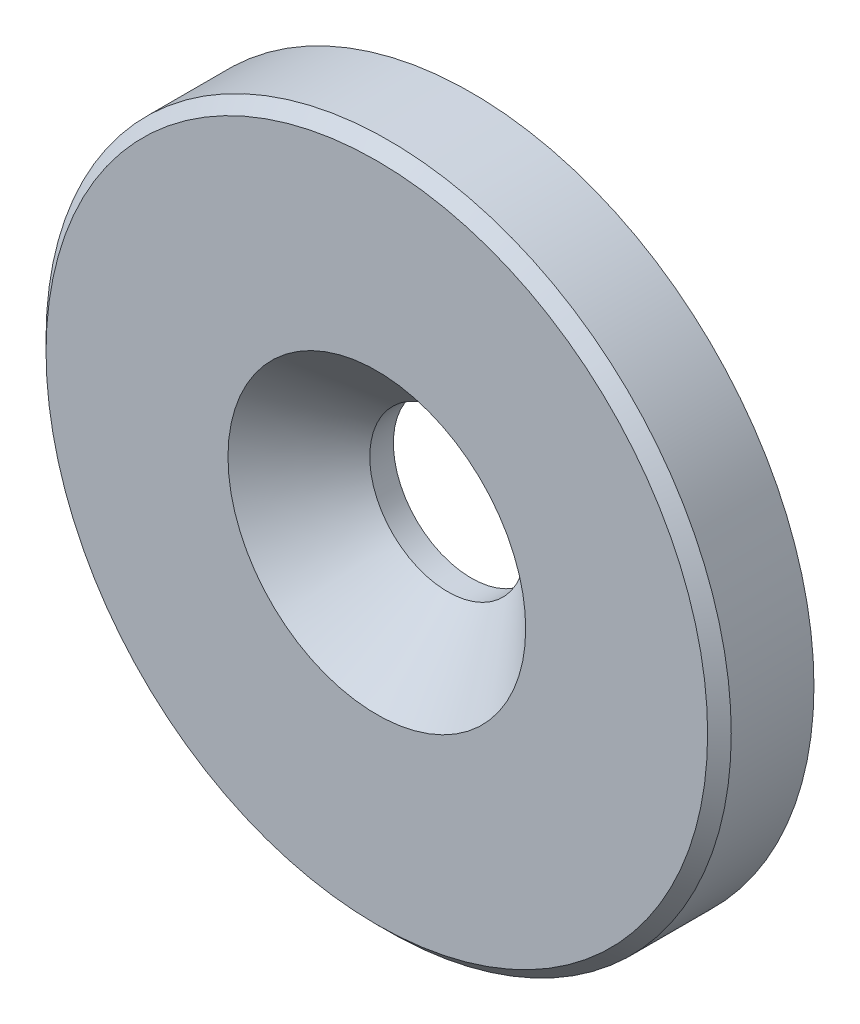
ISO-10303-21;
HEADER;
FILE_DESCRIPTION(('STEP AP214'),'2;1');
FILE_NAME('part.step','',(''),(''),'','','');
FILE_SCHEMA(('AUTOMOTIVE_DESIGN { 1 0 10303 214 1 1 1 1 }'));
ENDSEC;
DATA;
#1=APPLICATION_CONTEXT('core data for automotive mechanical design processes');
#2=APPLICATION_PROTOCOL_DEFINITION('international standard','automotive_design',2000,#1);
#3=PRODUCT_CONTEXT('',#1,'mechanical');
#4=PRODUCT('Part','Part','',(#3));
#5=PRODUCT_RELATED_PRODUCT_CATEGORY('part','',(#4));
#6=PRODUCT_DEFINITION_FORMATION('','',#4);
#7=PRODUCT_DEFINITION_CONTEXT('part definition',#1,'design');
#8=PRODUCT_DEFINITION('design','',#6,#7);
#9=PRODUCT_DEFINITION_SHAPE('','',#8);
#10=(LENGTH_UNIT() NAMED_UNIT(*) SI_UNIT(.MILLI.,.METRE.));
#11=(NAMED_UNIT(*) PLANE_ANGLE_UNIT() SI_UNIT($,.RADIAN.));
#12=(NAMED_UNIT(*) SI_UNIT($,.STERADIAN.) SOLID_ANGLE_UNIT());
#13=UNCERTAINTY_MEASURE_WITH_UNIT(LENGTH_MEASURE(1.E-05),#10,'distance_accuracy_value','');
#14=(GEOMETRIC_REPRESENTATION_CONTEXT(3) GLOBAL_UNCERTAINTY_ASSIGNED_CONTEXT((#13)) GLOBAL_UNIT_ASSIGNED_CONTEXT((#10,
#11,#12)) REPRESENTATION_CONTEXT('',''));
#15=CARTESIAN_POINT('',(0.,0.,0.));
#16=DIRECTION('',(0.,0.,1.));
#17=DIRECTION('',(1.,0.,0.));
#18=AXIS2_PLACEMENT_3D('',#15,#16,#17);
#19=CARTESIAN_POINT('',(0.,0.,4.));
#20=DIRECTION('',(0.,0.,1.));
#21=DIRECTION('',(1.,0.,0.));
#22=AXIS2_PLACEMENT_3D('',#19,#20,#21);
#23=PLANE('',#22);
#24=CARTESIAN_POINT('',(0.,0.,4.));
#25=DIRECTION('',(0.,0.,1.));
#26=DIRECTION('',(1.,0.,0.));
#27=AXIS2_PLACEMENT_3D('',#24,#25,#26);
#28=CIRCLE('',#27,14.);
#29=CARTESIAN_POINT('',(14.,0.,4.));
#30=VERTEX_POINT('',#29);
#31=EDGE_CURVE('E33',#30,#30,#28,.T.);
#32=ORIENTED_EDGE('',*,*,#31,.T.);
#33=EDGE_LOOP('',(#32));
#34=FACE_BOUND('',#33,.T.);
#35=CARTESIAN_POINT('',(0.,0.,4.));
#36=DIRECTION('',(0.,0.,1.));
#37=DIRECTION('',(1.,0.,0.));
#38=AXIS2_PLACEMENT_3D('',#35,#36,#37);
#39=CIRCLE('',#38,6.3);
#40=CARTESIAN_POINT('',(6.3,0.,4.));
#41=VERTEX_POINT('',#40);
#42=EDGE_CURVE('E41',#41,#41,#39,.T.);
#43=ORIENTED_EDGE('',*,*,#42,.F.);
#44=EDGE_LOOP('',(#43));
#45=FACE_BOUND('',#44,.T.);
#46=ADVANCED_FACE('F26',(#34,#45),#23,.T.);
#47=CARTESIAN_POINT('',(0.,0.,0.));
#48=DIRECTION('',(0.,0.,1.));
#49=DIRECTION('',(1.,0.,0.));
#50=AXIS2_PLACEMENT_3D('',#47,#48,#49);
#51=PLANE('',#50);
#52=CARTESIAN_POINT('',(0.,0.,0.));
#53=DIRECTION('',(0.,0.,1.));
#54=DIRECTION('',(1.,0.,0.));
#55=AXIS2_PLACEMENT_3D('',#52,#53,#54);
#56=CIRCLE('',#55,14.5);
#57=CARTESIAN_POINT('',(14.5,0.,0.));
#58=VERTEX_POINT('',#57);
#59=EDGE_CURVE('E37',#58,#58,#56,.T.);
#60=ORIENTED_EDGE('',*,*,#59,.F.);
#61=EDGE_LOOP('',(#60));
#62=FACE_BOUND('',#61,.T.);
#63=CARTESIAN_POINT('',(0.,0.,0.));
#64=DIRECTION('',(0.,0.,1.));
#65=DIRECTION('',(1.,0.,0.));
#66=AXIS2_PLACEMENT_3D('',#63,#64,#65);
#67=CIRCLE('',#66,3.3);
#68=CARTESIAN_POINT('',(3.3,0.,0.));
#69=VERTEX_POINT('',#68);
#70=EDGE_CURVE('E49',#69,#69,#67,.T.);
#71=ORIENTED_EDGE('',*,*,#70,.T.);
#72=EDGE_LOOP('',(#71));
#73=FACE_BOUND('',#72,.T.);
#74=ADVANCED_FACE('F53',(#62,#73),#51,.F.);
#75=CARTESIAN_POINT('',(0.,0.,4.));
#76=DIRECTION('',(0.,0.,-1.));
#77=DIRECTION('',(-1.,0.,0.));
#78=AXIS2_PLACEMENT_3D('',#75,#76,#77);
#79=CYLINDRICAL_SURFACE('',#78,14.5);
#80=CARTESIAN_POINT('',(0.,0.,3.5));
#81=DIRECTION('',(0.,0.,1.));
#82=DIRECTION('',(1.,0.,0.));
#83=AXIS2_PLACEMENT_3D('',#80,#81,#82);
#84=CIRCLE('',#83,14.5);
#85=CARTESIAN_POINT('',(14.5,0.,3.5));
#86=VERTEX_POINT('',#85);
#87=EDGE_CURVE('E10',#86,#86,#84,.F.);
#88=ORIENTED_EDGE('',*,*,#87,.T.);
#89=EDGE_LOOP('',(#88));
#90=FACE_BOUND('',#89,.T.);
#91=ORIENTED_EDGE('',*,*,#59,.T.);
#92=EDGE_LOOP('',(#91));
#93=FACE_BOUND('',#92,.T.);
#94=ADVANCED_FACE('F28',(#90,#93),#79,.T.);
#95=CARTESIAN_POINT('',(0.,0.,1.00000000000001));
#96=DIRECTION('',(0.,0.,1.));
#97=DIRECTION('',(1.,0.,0.));
#98=AXIS2_PLACEMENT_3D('',#95,#96,#97);
#99=CONICAL_SURFACE('',#98,3.3,0.78539816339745);
#100=ORIENTED_EDGE('',*,*,#42,.T.);
#101=EDGE_LOOP('',(#100));
#102=FACE_BOUND('',#101,.T.);
#103=CARTESIAN_POINT('',(0.,0.,1.00000000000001));
#104=DIRECTION('',(0.,0.,1.));
#105=DIRECTION('',(1.,0.,0.));
#106=AXIS2_PLACEMENT_3D('',#103,#104,#105);
#107=CIRCLE('',#106,3.3);
#108=CARTESIAN_POINT('',(3.3,0.,1.00000000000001));
#109=VERTEX_POINT('',#108);
#110=EDGE_CURVE('E46',#109,#109,#107,.T.);
#111=ORIENTED_EDGE('',*,*,#110,.F.);
#112=EDGE_LOOP('',(#111));
#113=FACE_BOUND('',#112,.T.);
#114=ADVANCED_FACE('F58',(#102,#113),#99,.F.);
#115=CARTESIAN_POINT('',(0.,0.,4.));
#116=DIRECTION('',(0.,0.,1.));
#117=DIRECTION('',(1.,0.,0.));
#118=AXIS2_PLACEMENT_3D('',#115,#116,#117);
#119=CYLINDRICAL_SURFACE('',#118,3.3);
#120=ORIENTED_EDGE('',*,*,#110,.T.);
#121=EDGE_LOOP('',(#120));
#122=FACE_BOUND('',#121,.T.);
#123=ORIENTED_EDGE('',*,*,#70,.F.);
#124=EDGE_LOOP('',(#123));
#125=FACE_BOUND('',#124,.T.);
#126=ADVANCED_FACE('F55',(#122,#125),#119,.F.);
#127=CARTESIAN_POINT('',(0.,0.,4.));
#128=DIRECTION('',(0.,0.,-1.));
#129=DIRECTION('',(-1.,0.,0.));
#130=AXIS2_PLACEMENT_3D('',#127,#128,#129);
#131=CONICAL_SURFACE('',#130,14.,0.785398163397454);
#132=ORIENTED_EDGE('',*,*,#87,.F.);
#133=EDGE_LOOP('',(#132));
#134=FACE_BOUND('',#133,.T.);
#135=ORIENTED_EDGE('',*,*,#31,.F.);
#136=EDGE_LOOP('',(#135));
#137=FACE_BOUND('',#136,.T.);
#138=ADVANCED_FACE('F57',(#134,#137),#131,.T.);
#139=CLOSED_SHELL('',(#46,#74,#94,#114,#126,#138));
#140=MANIFOLD_SOLID_BREP('B2',#139);
#141=ADVANCED_BREP_SHAPE_REPRESENTATION('',(#18,#140),#14);
#142=SHAPE_DEFINITION_REPRESENTATION(#9,#141);
ENDSEC;
END-ISO-10303-21;
